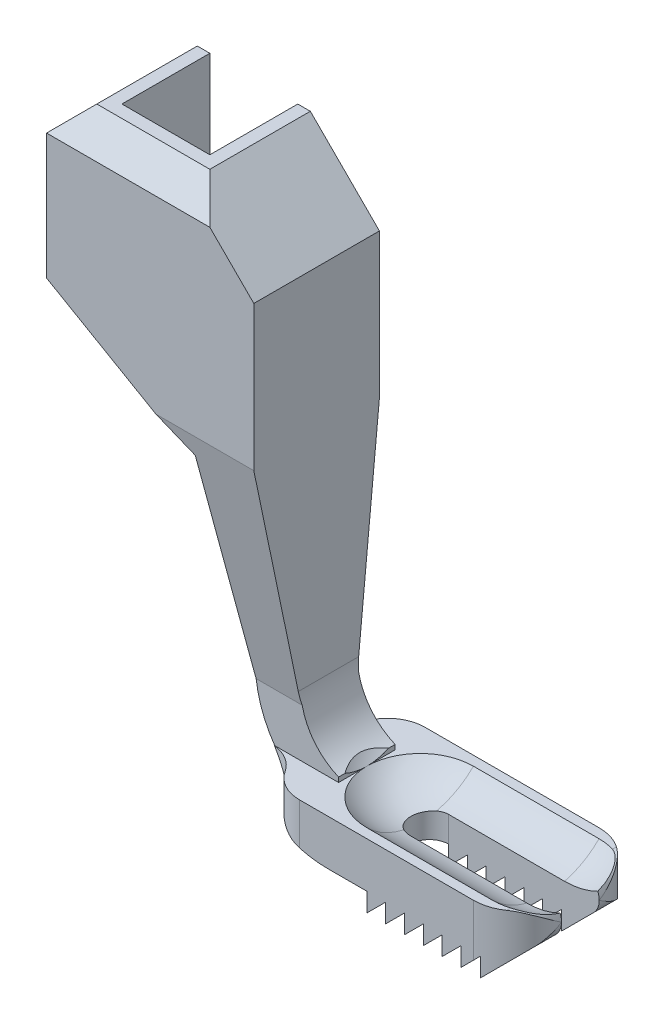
from build123d import *

# Parameters (mm, degrees)
LINEAR_AUSTRAGEN1_DEPTH      = 6
LINEAR_AUSTRAGEN1_DEPTH_BACK = 6
LINEAR_AUSTRAGEN2_DEPTH      = 45.79602175
LINEAR_AUSTRAGEN3_DEPTH      = 6
LINEAR_AUSTRAGEN3_DEPTH_BACK = 6
SKIZZE5_W                    = 17
SKIZZE5_H                    = 2.520828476
LINEAR_AUSTRAGEN4_DEPTH      = 40.922706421
LINEAR_AUSTRAGEN4_DEPTH_BACK = 40.922706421
SKIZZE7_W                    = 1
SKIZZE7_H                    = 5.121320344
LINEAR_AUSTRAGEN5_DEPTH      = 40.922706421
LINEAR_AUSTRAGEN5_DEPTH_BACK = 40.922706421
LINEAR_AUSTRAGEN6_DEPTH      = 42.471966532
FASE1_SIZE                   = 2
SKIZZE12_W                   = 7
SKIZZE12_H                   = 7
LINEAR_AUSTRAGEN8_DEPTH      = 50.309291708


with BuildPart() as part:
    # Skizze2 → Linear austragen1 (new, two sides: drawn at the far end of the back side and taken through both)
    with BuildSketch(Plane.XY.offset(-LINEAR_AUSTRAGEN1_DEPTH_BACK)):
        with BuildLine():
            Line((0, -8.5), (3.121320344, -8.5))
            Line((3.121320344, -8.5), (3.121320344, -10))
            Line((3.121320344, -10), (4.621320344, -8.5))
            Line((4.621320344, -8.5), (4.621320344, -10))
            Line((4.621320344, -10), (6.121320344, -8.5))
            Line((6.121320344, -8.5), (6.121320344, -10))
            Line((6.121320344, -10), (7.621320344, -8.5))
            Line((7.621320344, -8.5), (7.621320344, -10))
            Line((7.621320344, -10), (9.121320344, -8.5))
            Line((9.121320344, -8.5), (9.121320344, -10))
            Line((9.121320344, -10), (10.621320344, -8.5))
            Line((10.621320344, -8.5), (10.621320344, -10))
            Line((10.621320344, -10), (12.121320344, -8.5))
            Line((12.121320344, -8.5), (12.121320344, -10))
            Line((12.121320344, -10), (14.681980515, -7.439339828))
            ThreePointArc((14.681980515, -7.439339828), (15.007139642, -5.804654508), (13.621320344, -4.878679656))
            Line((13.621320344, -4.878679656), (0, -4.878679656))
            ThreePointArc((0, -4.878679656), (-3.449747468, -3.449747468), (-4.878679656, 0))
            Line((-4.878679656, 0), (-4.878679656, 28.526790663))
            Line((-4.878679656, 28.526790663), (-10.378679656, 34.026790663))
            Line((-10.378679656, 34.026790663), (-21.378679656, 34.026790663))
            Line((-21.378679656, 34.026790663), (-21.378679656, 22.026790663))
            Line((-21.378679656, 22.026790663), (-9.878679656, 15.387262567))
            Line((-9.878679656, 15.387262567), (-8.467654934, -0.740823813))
            ThreePointArc((-8.467654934, -0.740823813), (-5.742516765, -6.266857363), (0, -8.5))
        make_face()
    extrude(amount=LINEAR_AUSTRAGEN1_DEPTH + LINEAR_AUSTRAGEN1_DEPTH_BACK)

    # Skizze3 → Linear austragen2 (cut, through all)
    with BuildSketch(Plane(origin=(0, -4.878679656, 0), x_dir=(1, 0, 0), z_dir=(0, 1, 0))):
        with BuildLine():
            Line((15.121320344, 1.5), (3.121320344, 1.5))
            ThreePointArc((3.121320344, 1.5), (1.621320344, 0), (3.121320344, -1.5))
            Line((3.121320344, -1.5), (15.121320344, -1.5))
            Line((15.121320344, -1.5), (15.121320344, 1.5))
        make_face()
    extrude(amount=-LINEAR_AUSTRAGEN2_DEPTH, mode=Mode.SUBTRACT)

    # Skizze4 → Schnitt-Rotation1 (revolve, cut)
    with BuildSketch(Plane.XY):
        with BuildLine():
            Line((2.363961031, -6.636038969), (12.363961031, -6.636038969))
            ThreePointArc((12.363961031, -6.636038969), (16.606601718, -4.878679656), (18.363961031, -0.636038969))
            Line((18.363961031, -0.636038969), (-3.636038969, -0.636038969))
            ThreePointArc((-3.636038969, -0.636038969), (-1.878679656, -4.878679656), (2.363961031, -6.636038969))
        make_face()
    revolve(axis=Axis((-17.474748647, -0.636038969, 0), (1, 0, 0)), mode=Mode.SUBTRACT)

    # Skizze5 → Linear austragen3 (cut, two sides: drawn at the far end of the back side and taken through both)
    with BuildSketch(Plane.XY.offset(-LINEAR_AUSTRAGEN3_DEPTH_BACK)):
        with Locations((6.621320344, -3.618265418)):
            Rectangle(SKIZZE5_W, SKIZZE5_H)
    extrude(amount=LINEAR_AUSTRAGEN3_DEPTH + LINEAR_AUSTRAGEN3_DEPTH_BACK, mode=Mode.SUBTRACT)

    # Skizze7 → Linear austragen4 (cut, two sides: drawn at the far end of the back side and taken through both)
    with BuildSketch(Plane(origin=(-4.878679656, 0, 0), x_dir=(0, 0, -1), z_dir=(1, 0, 0)).offset(-LINEAR_AUSTRAGEN4_DEPTH_BACK)):
        Polygon((6, 34.026790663), (4, 34.026790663), (4, -4.878679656), (5, -4.878679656), (5, -10), (6, -10), align=None)
        with Locations((-5.5, -7.439339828)):
            Rectangle(SKIZZE7_W, SKIZZE7_H)
    extrude(amount=LINEAR_AUSTRAGEN4_DEPTH + LINEAR_AUSTRAGEN4_DEPTH_BACK, mode=Mode.SUBTRACT)

    # Skizze8 → Linear austragen5 (cut, two sides: drawn at the far end of the back side and taken through both)
    with BuildSketch(Plane(origin=(-4.878679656, 0, 0), x_dir=(0, 0, -1), z_dir=(1, 0, 0)).offset(-LINEAR_AUSTRAGEN5_DEPTH_BACK)):
        Polygon((4, 17), (2.25, -1), (2.25, -4.878679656), (4, -4.878679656), align=None)
        Polygon((-2.25, -4.878679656), (-2.25, -1), (-6, 17), (-6, -4.878679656), align=None)
    extrude(amount=LINEAR_AUSTRAGEN5_DEPTH + LINEAR_AUSTRAGEN5_DEPTH_BACK, mode=Mode.SUBTRACT)

    # Skizze10 → Linear austragen6 (cut, through all)
    with BuildSketch(Plane.XZ.offset(1)):
        with BuildLine():
            Line((-7.286490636, 2.25), (-7.286490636, 5))
            Line((-7.286490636, 5), (-2.242930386, 5))
            ThreePointArc((-2.242930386, 5), (-3.679071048, 4.633913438), (-4.764710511, 3.625))
            ThreePointArc((-4.764710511, 3.625), (-5.850349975, 2.616086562), (-7.286490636, 2.25))
        make_face()
        with BuildLine():
            Line((-7.286490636, -5), (-2.242930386, -5))
            ThreePointArc((-2.242930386, -5), (-3.679071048, -4.633913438), (-4.764710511, -3.625))
            ThreePointArc((-4.764710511, -3.625), (-5.850349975, -2.616086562), (-7.286490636, -2.25))
            Line((-7.286490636, -2.25), (-7.286490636, -5))
        make_face()
        with BuildLine():
            Line((15.121320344, 1.5), (15.121320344, 5))
            Line((15.121320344, 5), (11.621320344, 5))
            ThreePointArc((11.621320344, 5), (14.096194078, 3.974873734), (15.121320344, 1.5))
        make_face()
        with BuildLine():
            Line((15.121320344, -1.5), (15.121320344, -5))
            Line((15.121320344, -5), (11.621320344, -5))
            ThreePointArc((11.621320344, -5), (14.096194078, -3.974873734), (15.121320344, -1.5))
        make_face()
    extrude(amount=LINEAR_AUSTRAGEN6_DEPTH, mode=Mode.SUBTRACT)

    # Fase1
    fase1_edges = [part.edges().sort_by_distance(p)[0] for p in [
        (-21.378679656, 34.026790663, 1),
        (-15.878679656, 34.026790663, 6),
    ]]
    chamfer(fase1_edges, length=FASE1_SIZE)

    # Skizze12 → Linear austragen8 (cut, through all)
    with BuildSketch(Plane(origin=(0, 34.026790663, 0), x_dir=(1, 0, 0), z_dir=(0, 1, 0))):
        with Locations((-14.878679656, 0.5)):
            Rectangle(SKIZZE12_W, SKIZZE12_H)
    extrude(amount=-LINEAR_AUSTRAGEN8_DEPTH, mode=Mode.SUBTRACT)


solid = part.part
